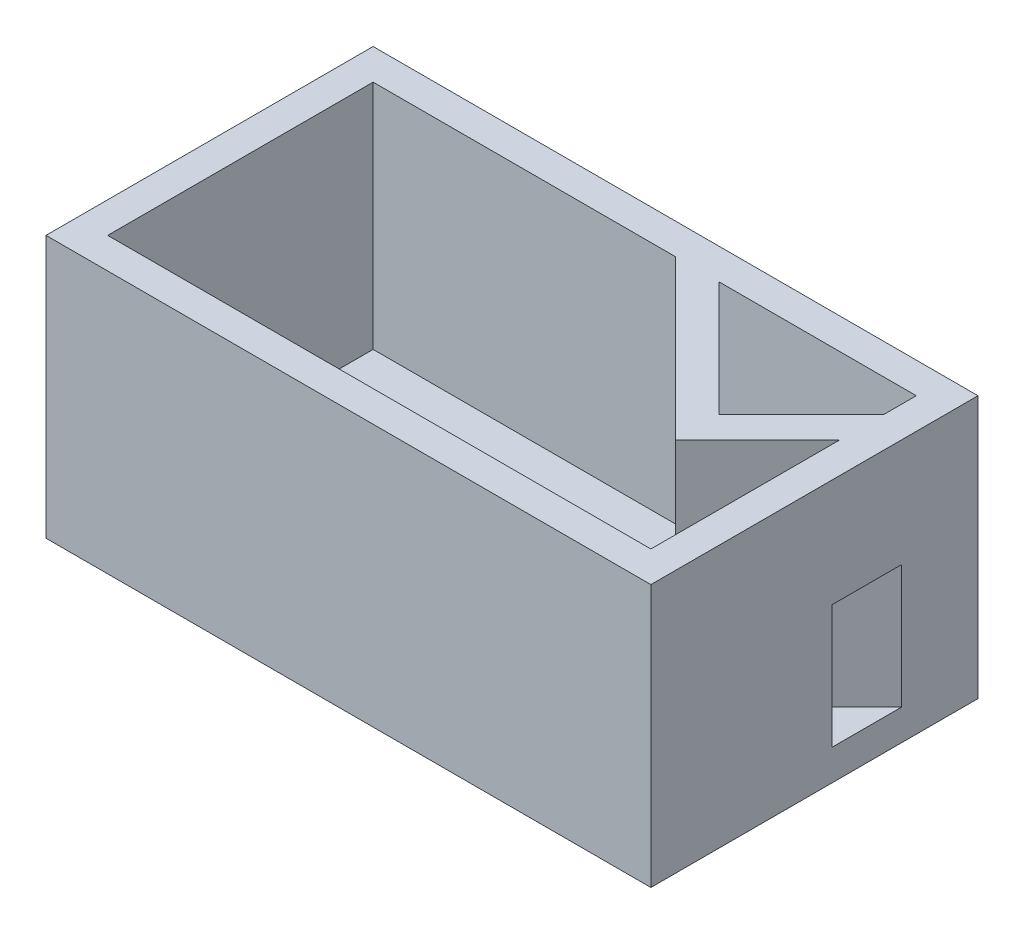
from build123d import *

# Parameters (mm, degrees)
SKETCH1_W           = 4978.4
SKETCH1_H           = 2159
BOSS_EXTRUDE1_DEPTH = 2692.4
SHELL1_T            = -254
RIB1_REACH          = 6059.62
SKETCH3_W           = 406.4
SKETCH3_H           = 1016
CUT_EXTRUDE1_DEPTH  = 4846.000147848


with BuildPart() as part:
    # Sketch1 → Boss-Extrude1 (new body)
    with BuildSketch(Plane.XY):
        with Locations((2489.2, 1079.5)):
            Rectangle(SKETCH1_W, SKETCH1_H)
    extrude(amount=BOSS_EXTRUDE1_DEPTH)

    # Shell1
    shell1_openings = [part.faces().sort_by_distance(p)[0] for p in [
        (2489.2, 2159, 1346.2),
    ]]
    offset(amount=SHELL1_T, openings=shell1_openings, kind=Kind.INTERSECTION)

    # Sketch2 walls → Rib1 (add, up to next)
    with BuildSketch(Plane(origin=(0, 2159, 0), x_dir=(1, 0, 0), z_dir=(0, 1, 0)), mode=Mode.PRIVATE) as rib1_sk1:
        Polygon((-1452.894154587, 3940.289032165), (4047.193363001, -1559.798485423), (9098.294154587, 3491.302306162), (8918.689032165, 3670.907428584), (4047.193363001, -1200.58824058), (-1273.289032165, 4119.894154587), align=None)
    rib1_tool1 = extrude(rib1_sk1.sketch, amount=-RIB1_REACH, mode=Mode.PRIVATE) - part.part
    add(rib1_tool1.solids().sort_by_distance((4385.796681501, 2159, 1041.590044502))[0])

    # Sketch3 → Cut-Extrude1 (cut, through all)
    with BuildSketch(Plane(origin=(4047.193363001, 2159, 1559.798485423), x_dir=(-0.7071067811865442, 0, -0.7071067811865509), z_dir=(0.7071067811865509, 0, -0.7071067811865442))):
        with Locations((-203.2, -1397)):
            Rectangle(SKETCH3_W, SKETCH3_H)
    extrude(amount=CUT_EXTRUDE1_DEPTH, mode=Mode.SUBTRACT)


solid = part.part
